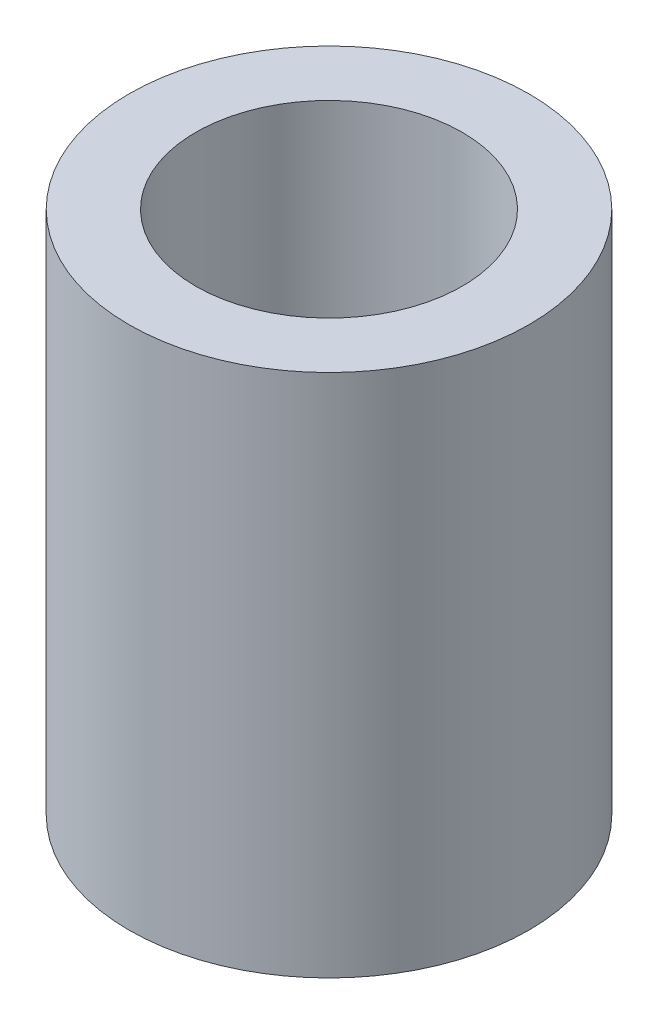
from build123d import *

# Parameters (mm, degrees)
BASE_EXTRUSION_DEPTH      = 59
BASE_EXTRUSION_DEPTH_BACK = 59
ESQUISSE1_R               = 45
ESQUISSE1_R_2             = 30


with BuildPart() as part:
    # Esquisse1 → Base-Extrusion (new, two sides: drawn at the far end of the back side and taken through both)
    with BuildSketch(Plane(origin=(0, 0, 0), x_dir=(1, 0, 0), z_dir=(0, 1, 0)).offset(-BASE_EXTRUSION_DEPTH_BACK)):
        with Locations(Location((0, 0, 0), (0, 0, 270))):
            Circle(ESQUISSE1_R)
        with Locations(Location((0, 0, 0), (0, 0, 270))):
            Circle(ESQUISSE1_R_2, mode=Mode.SUBTRACT)
    extrude(amount=BASE_EXTRUSION_DEPTH + BASE_EXTRUSION_DEPTH_BACK)


solid = part.part
